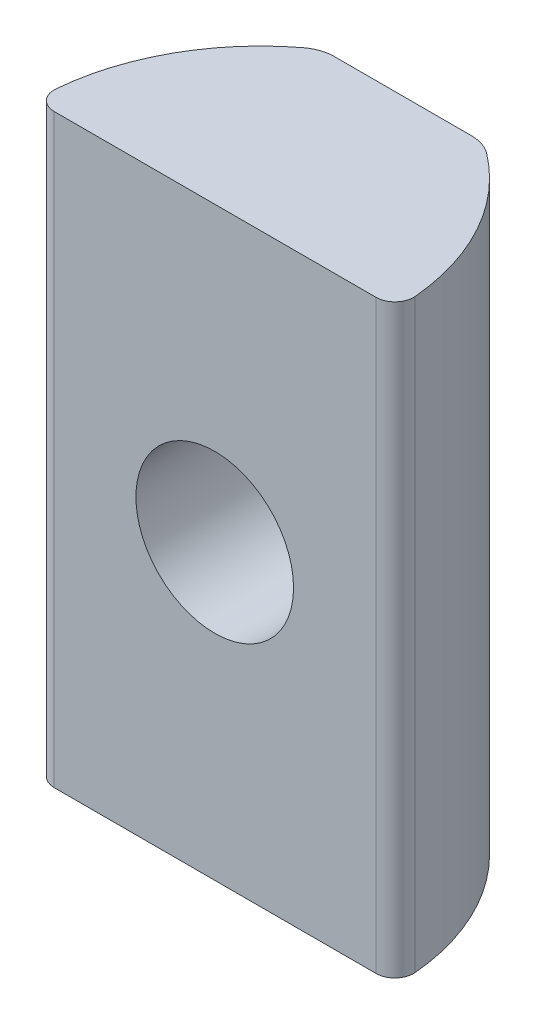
ISO-10303-21;
HEADER;
FILE_DESCRIPTION(('STEP AP214'),'2;1');
FILE_NAME('part.step','',(''),(''),'','','');
FILE_SCHEMA(('AUTOMOTIVE_DESIGN { 1 0 10303 214 1 1 1 1 }'));
ENDSEC;
DATA;
#1=APPLICATION_CONTEXT('core data for automotive mechanical design processes');
#2=APPLICATION_PROTOCOL_DEFINITION('international standard','automotive_design',2000,#1);
#3=PRODUCT_CONTEXT('',#1,'mechanical');
#4=PRODUCT('Part','Part','',(#3));
#5=PRODUCT_RELATED_PRODUCT_CATEGORY('part','',(#4));
#6=PRODUCT_DEFINITION_FORMATION('','',#4);
#7=PRODUCT_DEFINITION_CONTEXT('part definition',#1,'design');
#8=PRODUCT_DEFINITION('design','',#6,#7);
#9=PRODUCT_DEFINITION_SHAPE('','',#8);
#10=(LENGTH_UNIT() NAMED_UNIT(*) SI_UNIT(.MILLI.,.METRE.));
#11=(NAMED_UNIT(*) PLANE_ANGLE_UNIT() SI_UNIT($,.RADIAN.));
#12=(NAMED_UNIT(*) SI_UNIT($,.STERADIAN.) SOLID_ANGLE_UNIT());
#13=UNCERTAINTY_MEASURE_WITH_UNIT(LENGTH_MEASURE(1.E-05),#10,'distance_accuracy_value','');
#14=(GEOMETRIC_REPRESENTATION_CONTEXT(3) GLOBAL_UNCERTAINTY_ASSIGNED_CONTEXT((#13)) GLOBAL_UNIT_ASSIGNED_CONTEXT((#10,
#11,#12)) REPRESENTATION_CONTEXT('',''));
#15=CARTESIAN_POINT('',(0.,0.,0.));
#16=DIRECTION('',(0.,0.,1.));
#17=DIRECTION('',(1.,0.,0.));
#18=AXIS2_PLACEMENT_3D('',#15,#16,#17);
#19=CARTESIAN_POINT('',(1.83064212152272,-7.8,-4.9999999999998));
#20=DIRECTION('',(0.,0.,1.));
#21=DIRECTION('',(1.,0.,0.));
#22=AXIS2_PLACEMENT_3D('',#19,#20,#21);
#23=PLANE('',#22);
#24=DIRECTION('',(0.,1.,0.));
#25=VECTOR('',#24,1.);
#26=CARTESIAN_POINT('',(1.83064212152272,-7.8,-4.99999999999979));
#27=LINE('',#26,#25);
#28=CARTESIAN_POINT('',(1.83064212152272,1.00807846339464,-4.99999999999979));
#29=VERTEX_POINT('',#28);
#30=CARTESIAN_POINT('',(1.83064212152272,7.8,-4.99999999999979));
#31=VERTEX_POINT('',#30);
#32=EDGE_CURVE('E172',#29,#31,#27,.T.);
#33=ORIENTED_EDGE('',*,*,#32,.F.);
#34=CARTESIAN_POINT('',(-0.0115787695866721,0.,-5.));
#35=DIRECTION('',(0.,0.,1.));
#36=DIRECTION('',(1.,0.,0.));
#37=AXIS2_PLACEMENT_3D('',#34,#35,#36);
#38=CIRCLE('',#37,2.1);
#39=CARTESIAN_POINT('',(-1.83064212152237,1.04928953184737,-5.));
#40=VERTEX_POINT('',#39);
#41=EDGE_CURVE('E57',#29,#40,#38,.T.);
#42=ORIENTED_EDGE('',*,*,#41,.T.);
#43=DIRECTION('',(0.,1.,0.));
#44=VECTOR('',#43,1.);
#45=CARTESIAN_POINT('',(-1.83064212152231,-7.8,-4.99999999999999));
#46=LINE('',#45,#44);
#47=CARTESIAN_POINT('',(-1.83064212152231,7.8,-4.99999999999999));
#48=VERTEX_POINT('',#47);
#49=EDGE_CURVE('E176',#40,#48,#46,.T.);
#50=ORIENTED_EDGE('',*,*,#49,.T.);
#51=DIRECTION('',(1.,0.,0.));
#52=VECTOR('',#51,1.);
#53=CARTESIAN_POINT('',(1.83064212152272,7.8,-4.9999999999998));
#54=LINE('',#53,#52);
#55=EDGE_CURVE('E159',#48,#31,#54,.T.);
#56=ORIENTED_EDGE('',*,*,#55,.T.);
#57=EDGE_LOOP('',(#33,#42,#50,#56));
#58=FACE_BOUND('',#57,.T.);
#59=ADVANCED_FACE('F37',(#58),#23,.F.);
#60=CARTESIAN_POINT('',(-4.28842123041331,-7.8,-0.500000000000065));
#61=DIRECTION('',(0.,1.,0.));
#62=DIRECTION('',(0.,0.,1.));
#63=AXIS2_PLACEMENT_3D('',#60,#61,#62);
#64=CYLINDRICAL_SURFACE('',#63,0.499999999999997);
#65=CARTESIAN_POINT('',(-4.28842123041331,7.8,-0.500000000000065));
#66=DIRECTION('',(0.,-1.,0.));
#67=DIRECTION('',(0.,0.,-1.));
#68=AXIS2_PLACEMENT_3D('',#65,#66,#67);
#69=CIRCLE('',#68,0.499999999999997);
#70=CARTESIAN_POINT('',(-4.28842123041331,7.8,0.));
#71=VERTEX_POINT('',#70);
#72=CARTESIAN_POINT('',(-4.78647929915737,7.8,-0.544024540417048));
#73=VERTEX_POINT('',#72);
#74=EDGE_CURVE('E150',#71,#73,#69,.T.);
#75=ORIENTED_EDGE('',*,*,#74,.T.);
#76=DIRECTION('',(0.,1.,0.));
#77=VECTOR('',#76,1.);
#78=CARTESIAN_POINT('',(-4.78647929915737,-7.8,-0.544024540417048));
#79=LINE('',#78,#77);
#80=CARTESIAN_POINT('',(-4.78647929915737,-7.8,-0.544024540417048));
#81=VERTEX_POINT('',#80);
#82=EDGE_CURVE('E50',#81,#73,#79,.T.);
#83=ORIENTED_EDGE('',*,*,#82,.F.);
#84=CARTESIAN_POINT('',(-4.28842123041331,-7.8,-0.500000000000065));
#85=DIRECTION('',(0.,-1.,0.));
#86=DIRECTION('',(0.,0.,-1.));
#87=AXIS2_PLACEMENT_3D('',#84,#85,#86);
#88=CIRCLE('',#87,0.499999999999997);
#89=CARTESIAN_POINT('',(-4.28842123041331,-7.8,0.));
#90=VERTEX_POINT('',#89);
#91=EDGE_CURVE('E168',#90,#81,#88,.T.);
#92=ORIENTED_EDGE('',*,*,#91,.F.);
#93=DIRECTION('',(0.,1.,0.));
#94=VECTOR('',#93,1.);
#95=CARTESIAN_POINT('',(-4.28842123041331,-7.8,0.));
#96=LINE('',#95,#94);
#97=EDGE_CURVE('E146',#90,#71,#96,.T.);
#98=ORIENTED_EDGE('',*,*,#97,.T.);
#99=EDGE_LOOP('',(#75,#83,#92,#98));
#100=FACE_BOUND('',#99,.T.);
#101=ADVANCED_FACE('F39',(#100),#64,.T.);
#102=CARTESIAN_POINT('',(1.1902175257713,-7.8,-0.015730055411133));
#103=DIRECTION('',(0.,1.,0.));
#104=DIRECTION('',(0.,0.,1.));
#105=AXIS2_PLACEMENT_3D('',#102,#103,#104);
#106=CYLINDRICAL_SURFACE('',#105,6.00000000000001);
#107=CARTESIAN_POINT('',(1.1902175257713,7.8,-0.015730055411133));
#108=DIRECTION('',(0.,-1.,0.));
#109=DIRECTION('',(0.,0.,-1.));
#110=AXIS2_PLACEMENT_3D('',#107,#108,#109);
#111=CIRCLE('',#110,6.00000000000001);
#112=CARTESIAN_POINT('',(-2.43481405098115,7.8,-4.79685398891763));
#113=VERTEX_POINT('',#112);
#114=EDGE_CURVE('E153',#73,#113,#111,.T.);
#115=ORIENTED_EDGE('',*,*,#114,.T.);
#116=DIRECTION('',(0.,1.,0.));
#117=VECTOR('',#116,1.);
#118=CARTESIAN_POINT('',(-2.43481405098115,-7.8,-4.79685398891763));
#119=LINE('',#118,#117);
#120=CARTESIAN_POINT('',(-2.43481405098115,-7.8,-4.79685398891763));
#121=VERTEX_POINT('',#120);
#122=EDGE_CURVE('E180',#121,#113,#119,.T.);
#123=ORIENTED_EDGE('',*,*,#122,.F.);
#124=CARTESIAN_POINT('',(1.1902175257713,-7.8,-0.015730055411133));
#125=DIRECTION('',(0.,-1.,0.));
#126=DIRECTION('',(0.,0.,-1.));
#127=AXIS2_PLACEMENT_3D('',#124,#125,#126);
#128=CIRCLE('',#127,6.00000000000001);
#129=EDGE_CURVE('E107',#81,#121,#128,.T.);
#130=ORIENTED_EDGE('',*,*,#129,.F.);
#131=ORIENTED_EDGE('',*,*,#82,.T.);
#132=EDGE_LOOP('',(#115,#123,#130,#131));
#133=FACE_BOUND('',#132,.T.);
#134=ADVANCED_FACE('F183',(#133),#106,.T.);
#135=CARTESIAN_POINT('',(-1.83064212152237,-7.8,-3.99999999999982));
#136=DIRECTION('',(0.,1.,0.));
#137=DIRECTION('',(0.,0.,1.));
#138=AXIS2_PLACEMENT_3D('',#135,#136,#137);
#139=CYLINDRICAL_SURFACE('',#138,1.00000000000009);
#140=ORIENTED_EDGE('',*,*,#49,.F.);
#141=CARTESIAN_POINT('',(-1.83064212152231,1.04928953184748,-4.99999999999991));
#142=CARTESIAN_POINT('',(-1.85931290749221,0.9995958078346,-4.99997824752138));
#143=CARTESIAN_POINT('',(-1.88592355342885,0.948748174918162,-4.99876716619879));
#144=CARTESIAN_POINT('',(-1.93487296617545,0.845113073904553,-4.99486164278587));
#145=CARTESIAN_POINT('',(-1.95721351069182,0.792326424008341,-4.99216781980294));
#146=CARTESIAN_POINT('',(-1.99749887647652,0.685129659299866,-4.98619006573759));
#147=CARTESIAN_POINT('',(-2.01544291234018,0.63071925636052,-4.98290602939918));
#148=CARTESIAN_POINT('',(-2.04683108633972,0.52060095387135,-4.9764834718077));
#149=CARTESIAN_POINT('',(-2.0602748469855,0.464892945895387,-4.97334496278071));
#150=CARTESIAN_POINT('',(-2.08272823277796,0.351730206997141,-4.96777507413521));
#151=CARTESIAN_POINT('',(-2.09167236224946,0.29426191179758,-4.96535433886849));
#152=CARTESIAN_POINT('',(-2.10476520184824,0.178743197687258,-4.96171881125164));
#153=CARTESIAN_POINT('',(-2.10891405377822,0.120692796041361,-4.96050398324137));
#154=CARTESIAN_POINT('',(-2.11237855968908,0.00445471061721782,-4.95949357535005));
#155=CARTESIAN_POINT('',(-2.1116958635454,-0.0537329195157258,-4.95969751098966));
#156=CARTESIAN_POINT('',(-2.10550755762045,-0.169827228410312,-4.96148802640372));
#157=CARTESIAN_POINT('',(-2.10000206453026,-0.227733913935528,-4.96307457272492));
#158=CARTESIAN_POINT('',(-2.08434192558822,-0.341939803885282,-4.96731619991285));
#159=CARTESIAN_POINT('',(-2.07426200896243,-0.398249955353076,-4.96995402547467));
#160=CARTESIAN_POINT('',(-2.04955274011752,-0.509830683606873,-4.97582744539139));
#161=CARTESIAN_POINT('',(-2.03492332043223,-0.565101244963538,-4.97906304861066));
#162=CARTESIAN_POINT('',(-2.00123510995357,-0.674182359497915,-4.98549016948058));
#163=CARTESIAN_POINT('',(-1.98218322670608,-0.727995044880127,-4.98868174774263));
#164=CARTESIAN_POINT('',(-1.93975145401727,-0.833906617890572,-4.99426085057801));
#165=CARTESIAN_POINT('',(-1.91637386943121,-0.886006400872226,-4.99664880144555));
#166=CARTESIAN_POINT('',(-1.87196396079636,-0.975076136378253,-4.99932317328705));
#167=CARTESIAN_POINT('',(-1.85186497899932,-1.01250292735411,-4.99999124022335));
#168=CARTESIAN_POINT('',(-1.83064212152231,-1.04928953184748,-4.99999999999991));
#169=B_SPLINE_CURVE_WITH_KNOTS('',3,(#141,#142,#143,#144,#145,#146,#147,#148,#149,#150,#151,
#152,#153,#154,#155,#156,#157,#158,#159,#160,#161,#162,#163,#164,#165,#166,#167,#168),
.UNSPECIFIED.,.F.,.F.,(4,2,2,2,2,2,2,2,2,2,2,2,2,4),(0.,0.172013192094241,0.343954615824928,
0.515926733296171,0.687913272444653,0.862335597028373,1.0367527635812,1.21111037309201,
1.38546376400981,1.55706605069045,1.72867088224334,1.9000094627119,2.0712570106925,
2.1986357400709),.UNSPECIFIED.);
#170=CARTESIAN_POINT('',(-1.83064212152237,-1.04928953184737,-5.));
#171=VERTEX_POINT('',#170);
#172=EDGE_CURVE('E154',#40,#171,#169,.T.);
#173=ORIENTED_EDGE('',*,*,#172,.T.);
#174=CARTESIAN_POINT('',(-1.83064212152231,-7.8,-4.99999999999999));
#175=VERTEX_POINT('',#174);
#176=EDGE_CURVE('E177',#175,#171,#46,.T.);
#177=ORIENTED_EDGE('',*,*,#176,.F.);
#178=CARTESIAN_POINT('',(-1.83064212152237,-7.8,-3.99999999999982));
#179=DIRECTION('',(0.,-1.,0.));
#180=DIRECTION('',(0.,0.,-1.));
#181=AXIS2_PLACEMENT_3D('',#178,#179,#180);
#182=CIRCLE('',#181,1.00000000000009);
#183=EDGE_CURVE('E199',#121,#175,#182,.T.);
#184=ORIENTED_EDGE('',*,*,#183,.F.);
#185=ORIENTED_EDGE('',*,*,#122,.T.);
#186=CARTESIAN_POINT('',(-1.83064212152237,7.8,-3.99999999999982));
#187=DIRECTION('',(0.,-1.,0.));
#188=DIRECTION('',(0.,0.,-1.));
#189=AXIS2_PLACEMENT_3D('',#186,#187,#188);
#190=CIRCLE('',#189,1.00000000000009);
#191=EDGE_CURVE('E156',#113,#48,#190,.T.);
#192=ORIENTED_EDGE('',*,*,#191,.T.);
#193=EDGE_LOOP('',(#140,#173,#177,#184,#185,#192));
#194=FACE_BOUND('',#193,.T.);
#195=ADVANCED_FACE('F194',(#194),#139,.T.);
#196=ORIENTED_EDGE('',*,*,#176,.T.);
#197=CARTESIAN_POINT('',(1.83064212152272,-1.00807846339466,-5.));
#198=VERTEX_POINT('',#197);
#199=EDGE_CURVE('E252',#171,#198,#38,.T.);
#200=ORIENTED_EDGE('',*,*,#199,.T.);
#201=CARTESIAN_POINT('',(1.83064212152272,-7.8,-4.99999999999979));
#202=VERTEX_POINT('',#201);
#203=EDGE_CURVE('E173',#202,#198,#27,.T.);
#204=ORIENTED_EDGE('',*,*,#203,.F.);
#205=DIRECTION('',(1.,0.,0.));
#206=VECTOR('',#205,1.);
#207=CARTESIAN_POINT('',(1.83064212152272,-7.8,-4.9999999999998));
#208=LINE('',#207,#206);
#209=EDGE_CURVE('E201',#175,#202,#208,.T.);
#210=ORIENTED_EDGE('',*,*,#209,.F.);
#211=EDGE_LOOP('',(#196,#200,#204,#210));
#212=FACE_BOUND('',#211,.T.);
#213=ADVANCED_FACE('F235',(#212),#23,.F.);
#214=CARTESIAN_POINT('',(1.83064212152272,-7.8,-3.99999999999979));
#215=DIRECTION('',(0.,1.,0.));
#216=DIRECTION('',(0.,0.,1.));
#217=AXIS2_PLACEMENT_3D('',#214,#215,#216);
#218=CYLINDRICAL_SURFACE('',#217,1.);
#219=ORIENTED_EDGE('',*,*,#203,.T.);
#220=CARTESIAN_POINT('',(1.83064212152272,-1.00807846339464,-4.99999999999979));
#221=CARTESIAN_POINT('',(1.85838192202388,-0.957395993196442,-4.99997663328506));
#222=CARTESIAN_POINT('',(1.88400841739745,-0.905587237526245,-4.99884572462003));
#223=CARTESIAN_POINT('',(1.93088941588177,-0.800088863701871,-4.99524626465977));
#224=CARTESIAN_POINT('',(1.95214531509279,-0.746399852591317,-4.99277814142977));
#225=CARTESIAN_POINT('',(1.99012509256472,-0.637573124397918,-4.98738518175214));
#226=CARTESIAN_POINT('',(2.00685667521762,-0.582438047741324,-4.98446113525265));
#227=CARTESIAN_POINT('',(2.0357383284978,-0.470964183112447,-4.97885292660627));
#228=CARTESIAN_POINT('',(2.04788816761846,-0.41462533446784,-4.97616877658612));
#229=CARTESIAN_POINT('',(2.06764240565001,-0.300399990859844,-4.97156331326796));
#230=CARTESIAN_POINT('',(2.07518841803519,-0.242502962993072,-4.96965189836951));
#231=CARTESIAN_POINT('',(2.08543432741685,-0.126255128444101,-4.96701045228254));
#232=CARTESIAN_POINT('',(2.08813438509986,-0.0679043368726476,-4.96628038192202));
#233=CARTESIAN_POINT('',(2.08866473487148,0.0488239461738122,-4.9661389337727));
#234=CARTESIAN_POINT('',(2.08649479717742,0.107201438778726,-4.96672761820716));
#235=CARTESIAN_POINT('',(2.07730409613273,0.223548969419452,-4.96911303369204));
#236=CARTESIAN_POINT('',(2.07028312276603,0.28151898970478,-4.97090981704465));
#237=CARTESIAN_POINT('',(2.05130960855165,0.397484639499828,-4.97539851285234));
#238=CARTESIAN_POINT('',(2.03928621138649,0.455468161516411,-4.97810317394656));
#239=CARTESIAN_POINT('',(2.01039456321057,0.570196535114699,-4.98382142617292));
#240=CARTESIAN_POINT('',(1.99352637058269,0.626941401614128,-4.98683501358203));
#241=CARTESIAN_POINT('',(1.95501155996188,0.738941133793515,-4.99242882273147));
#242=CARTESIAN_POINT('',(1.93335542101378,0.794192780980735,-4.99500816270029));
#243=CARTESIAN_POINT('',(1.88542536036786,0.902719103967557,-4.99878090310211));
#244=CARTESIAN_POINT('',(1.85915012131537,0.955993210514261,-4.99997390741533));
#245=CARTESIAN_POINT('',(1.83064212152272,1.00807846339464,-4.99999999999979));
#246=B_SPLINE_CURVE_WITH_KNOTS('',3,(#220,#221,#222,#223,#224,#225,#226,#227,#228,#229,#230,
#231,#232,#233,#234,#235,#236,#237,#238,#239,#240,#241,#242,#243,#244,#245),.UNSPECIFIED.,.F.,
.F.,(4,2,2,2,2,2,2,2,2,2,2,2,4),(0.,0.173236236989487,0.346417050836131,0.519301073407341,
0.692193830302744,0.867235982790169,1.04227233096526,1.21731693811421,1.39236912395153,
1.56999011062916,1.74760895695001,1.9255842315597,2.10361034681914),.UNSPECIFIED.);
#247=EDGE_CURVE('E11',#198,#29,#246,.T.);
#248=ORIENTED_EDGE('',*,*,#247,.T.);
#249=ORIENTED_EDGE('',*,*,#32,.T.);
#250=CARTESIAN_POINT('',(1.83064212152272,7.8,-3.99999999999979));
#251=DIRECTION('',(0.,-1.,0.));
#252=DIRECTION('',(0.,0.,-1.));
#253=AXIS2_PLACEMENT_3D('',#250,#251,#252);
#254=CIRCLE('',#253,1.);
#255=CARTESIAN_POINT('',(2.43481405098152,7.8,-4.79685398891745));
#256=VERTEX_POINT('',#255);
#257=EDGE_CURVE('E162',#31,#256,#254,.T.);
#258=ORIENTED_EDGE('',*,*,#257,.T.);
#259=DIRECTION('',(0.,1.,0.));
#260=VECTOR('',#259,1.);
#261=CARTESIAN_POINT('',(2.43481405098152,-7.8,-4.79685398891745));
#262=LINE('',#261,#260);
#263=CARTESIAN_POINT('',(2.43481405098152,-7.8,-4.79685398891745));
#264=VERTEX_POINT('',#263);
#265=EDGE_CURVE('E141',#264,#256,#262,.T.);
#266=ORIENTED_EDGE('',*,*,#265,.F.);
#267=CARTESIAN_POINT('',(1.83064212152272,-7.8,-3.99999999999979));
#268=DIRECTION('',(0.,-1.,0.));
#269=DIRECTION('',(0.,0.,-1.));
#270=AXIS2_PLACEMENT_3D('',#267,#268,#269);
#271=CIRCLE('',#270,1.);
#272=EDGE_CURVE('E129',#202,#264,#271,.T.);
#273=ORIENTED_EDGE('',*,*,#272,.F.);
#274=EDGE_LOOP('',(#219,#248,#249,#258,#266,#273));
#275=FACE_BOUND('',#274,.T.);
#276=ADVANCED_FACE('F232',(#275),#218,.T.);
#277=CARTESIAN_POINT('',(-1.19021752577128,-7.8,-0.0157300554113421));
#278=DIRECTION('',(0.,1.,0.));
#279=DIRECTION('',(0.,0.,1.));
#280=AXIS2_PLACEMENT_3D('',#277,#278,#279);
#281=CYLINDRICAL_SURFACE('',#280,5.99999999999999);
#282=CARTESIAN_POINT('',(-1.19021752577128,7.8,-0.0157300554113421));
#283=DIRECTION('',(0.,-1.,0.));
#284=DIRECTION('',(0.,0.,-1.));
#285=AXIS2_PLACEMENT_3D('',#282,#283,#284);
#286=CIRCLE('',#285,5.99999999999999);
#287=CARTESIAN_POINT('',(4.78647929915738,7.8,-0.544024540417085));
#288=VERTEX_POINT('',#287);
#289=EDGE_CURVE('E138',#256,#288,#286,.T.);
#290=ORIENTED_EDGE('',*,*,#289,.T.);
#291=DIRECTION('',(0.,1.,0.));
#292=VECTOR('',#291,1.);
#293=CARTESIAN_POINT('',(4.78647929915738,-7.8,-0.544024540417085));
#294=LINE('',#293,#292);
#295=CARTESIAN_POINT('',(4.78647929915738,-7.8,-0.544024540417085));
#296=VERTEX_POINT('',#295);
#297=EDGE_CURVE('E135',#296,#288,#294,.T.);
#298=ORIENTED_EDGE('',*,*,#297,.F.);
#299=CARTESIAN_POINT('',(-1.19021752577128,-7.8,-0.0157300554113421));
#300=DIRECTION('',(0.,-1.,0.));
#301=DIRECTION('',(0.,0.,-1.));
#302=AXIS2_PLACEMENT_3D('',#299,#300,#301);
#303=CIRCLE('',#302,5.99999999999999);
#304=EDGE_CURVE('E122',#264,#296,#303,.T.);
#305=ORIENTED_EDGE('',*,*,#304,.F.);
#306=ORIENTED_EDGE('',*,*,#265,.T.);
#307=EDGE_LOOP('',(#290,#298,#305,#306));
#308=FACE_BOUND('',#307,.T.);
#309=ADVANCED_FACE('F136',(#308),#281,.T.);
#310=CARTESIAN_POINT('',(4.28842123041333,-7.8,-0.499999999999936));
#311=DIRECTION('',(0.,1.,0.));
#312=DIRECTION('',(0.,0.,1.));
#313=AXIS2_PLACEMENT_3D('',#310,#311,#312);
#314=CYLINDRICAL_SURFACE('',#313,0.499999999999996);
#315=CARTESIAN_POINT('',(4.28842123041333,7.8,-0.499999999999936));
#316=DIRECTION('',(0.,-1.,0.));
#317=DIRECTION('',(0.,0.,-1.));
#318=AXIS2_PLACEMENT_3D('',#315,#316,#317);
#319=CIRCLE('',#318,0.499999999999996);
#320=CARTESIAN_POINT('',(4.28842123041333,7.8,0.));
#321=VERTEX_POINT('',#320);
#322=EDGE_CURVE('E165',#288,#321,#319,.T.);
#323=ORIENTED_EDGE('',*,*,#322,.T.);
#324=DIRECTION('',(0.,1.,0.));
#325=VECTOR('',#324,1.);
#326=CARTESIAN_POINT('',(4.28842123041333,-7.8,0.));
#327=LINE('',#326,#325);
#328=CARTESIAN_POINT('',(4.28842123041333,-7.8,0.));
#329=VERTEX_POINT('',#328);
#330=EDGE_CURVE('E142',#329,#321,#327,.T.);
#331=ORIENTED_EDGE('',*,*,#330,.F.);
#332=CARTESIAN_POINT('',(4.28842123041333,-7.8,-0.499999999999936));
#333=DIRECTION('',(0.,-1.,0.));
#334=DIRECTION('',(0.,0.,-1.));
#335=AXIS2_PLACEMENT_3D('',#332,#333,#334);
#336=CIRCLE('',#335,0.499999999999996);
#337=EDGE_CURVE('E126',#296,#329,#336,.T.);
#338=ORIENTED_EDGE('',*,*,#337,.F.);
#339=ORIENTED_EDGE('',*,*,#297,.T.);
#340=EDGE_LOOP('',(#323,#331,#338,#339));
#341=FACE_BOUND('',#340,.T.);
#342=ADVANCED_FACE('F144',(#341),#314,.T.);
#343=CARTESIAN_POINT('',(-4.28842123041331,-7.8,0.));
#344=DIRECTION('',(0.,0.,-1.));
#345=DIRECTION('',(-1.,0.,0.));
#346=AXIS2_PLACEMENT_3D('',#343,#344,#345);
#347=PLANE('',#346);
#348=CARTESIAN_POINT('',(-0.0115787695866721,0.,0.));
#349=DIRECTION('',(0.,0.,1.));
#350=DIRECTION('',(1.,0.,0.));
#351=AXIS2_PLACEMENT_3D('',#348,#349,#350);
#352=CIRCLE('',#351,2.1);
#353=CARTESIAN_POINT('',(2.08842123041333,0.,0.));
#354=VERTEX_POINT('',#353);
#355=EDGE_CURVE('E253',#354,#354,#352,.T.);
#356=ORIENTED_EDGE('',*,*,#355,.F.);
#357=EDGE_LOOP('',(#356));
#358=FACE_BOUND('',#357,.T.);
#359=DIRECTION('',(-1.,0.,0.));
#360=VECTOR('',#359,1.);
#361=CARTESIAN_POINT('',(-4.28842123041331,7.8,0.));
#362=LINE('',#361,#360);
#363=EDGE_CURVE('E98',#321,#71,#362,.T.);
#364=ORIENTED_EDGE('',*,*,#363,.T.);
#365=ORIENTED_EDGE('',*,*,#97,.F.);
#366=DIRECTION('',(-1.,0.,0.));
#367=VECTOR('',#366,1.);
#368=CARTESIAN_POINT('',(-4.28842123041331,-7.8,0.));
#369=LINE('',#368,#367);
#370=EDGE_CURVE('E65',#329,#90,#369,.T.);
#371=ORIENTED_EDGE('',*,*,#370,.F.);
#372=ORIENTED_EDGE('',*,*,#330,.T.);
#373=EDGE_LOOP('',(#364,#365,#371,#372));
#374=FACE_BOUND('',#373,.T.);
#375=ADVANCED_FACE('F223',(#358,#374),#347,.F.);
#376=CARTESIAN_POINT('',(-4.28842123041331,-7.8,-0.500000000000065));
#377=DIRECTION('',(0.,-1.,0.));
#378=DIRECTION('',(0.,0.,-1.));
#379=AXIS2_PLACEMENT_3D('',#376,#377,#378);
#380=PLANE('',#379);
#381=ORIENTED_EDGE('',*,*,#91,.T.);
#382=ORIENTED_EDGE('',*,*,#129,.T.);
#383=ORIENTED_EDGE('',*,*,#183,.T.);
#384=ORIENTED_EDGE('',*,*,#209,.T.);
#385=ORIENTED_EDGE('',*,*,#272,.T.);
#386=ORIENTED_EDGE('',*,*,#304,.T.);
#387=ORIENTED_EDGE('',*,*,#337,.T.);
#388=ORIENTED_EDGE('',*,*,#370,.T.);
#389=EDGE_LOOP('',(#381,#382,#383,#384,#385,#386,#387,#388));
#390=FACE_BOUND('',#389,.T.);
#391=ADVANCED_FACE('F124',(#390),#380,.T.);
#392=CARTESIAN_POINT('',(-4.28842123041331,7.8,-0.500000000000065));
#393=DIRECTION('',(0.,-1.,0.));
#394=DIRECTION('',(0.,0.,-1.));
#395=AXIS2_PLACEMENT_3D('',#392,#393,#394);
#396=PLANE('',#395);
#397=ORIENTED_EDGE('',*,*,#74,.F.);
#398=ORIENTED_EDGE('',*,*,#363,.F.);
#399=ORIENTED_EDGE('',*,*,#322,.F.);
#400=ORIENTED_EDGE('',*,*,#289,.F.);
#401=ORIENTED_EDGE('',*,*,#257,.F.);
#402=ORIENTED_EDGE('',*,*,#55,.F.);
#403=ORIENTED_EDGE('',*,*,#191,.F.);
#404=ORIENTED_EDGE('',*,*,#114,.F.);
#405=EDGE_LOOP('',(#397,#398,#399,#400,#401,#402,#403,#404));
#406=FACE_BOUND('',#405,.T.);
#407=ADVANCED_FACE('F188',(#406),#396,.F.);
#408=CARTESIAN_POINT('',(-0.0115787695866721,0.,0.));
#409=DIRECTION('',(0.,0.,1.));
#410=DIRECTION('',(1.,0.,0.));
#411=AXIS2_PLACEMENT_3D('',#408,#409,#410);
#412=CYLINDRICAL_SURFACE('',#411,2.1);
#413=ORIENTED_EDGE('',*,*,#355,.T.);
#414=EDGE_LOOP('',(#413));
#415=FACE_BOUND('',#414,.T.);
#416=ORIENTED_EDGE('',*,*,#41,.F.);
#417=ORIENTED_EDGE('',*,*,#247,.F.);
#418=ORIENTED_EDGE('',*,*,#199,.F.);
#419=ORIENTED_EDGE('',*,*,#172,.F.);
#420=EDGE_LOOP('',(#416,#417,#418,#419));
#421=FACE_BOUND('',#420,.T.);
#422=ADVANCED_FACE('F215',(#415,#421),#412,.F.);
#423=CLOSED_SHELL('',(#59,#101,#134,#195,#213,#276,#309,#342,#375,#391,#407,#422));
#424=MANIFOLD_SOLID_BREP('B2',#423);
#425=ADVANCED_BREP_SHAPE_REPRESENTATION('',(#18,#424),#14);
#426=SHAPE_DEFINITION_REPRESENTATION(#9,#425);
ENDSEC;
END-ISO-10303-21;
